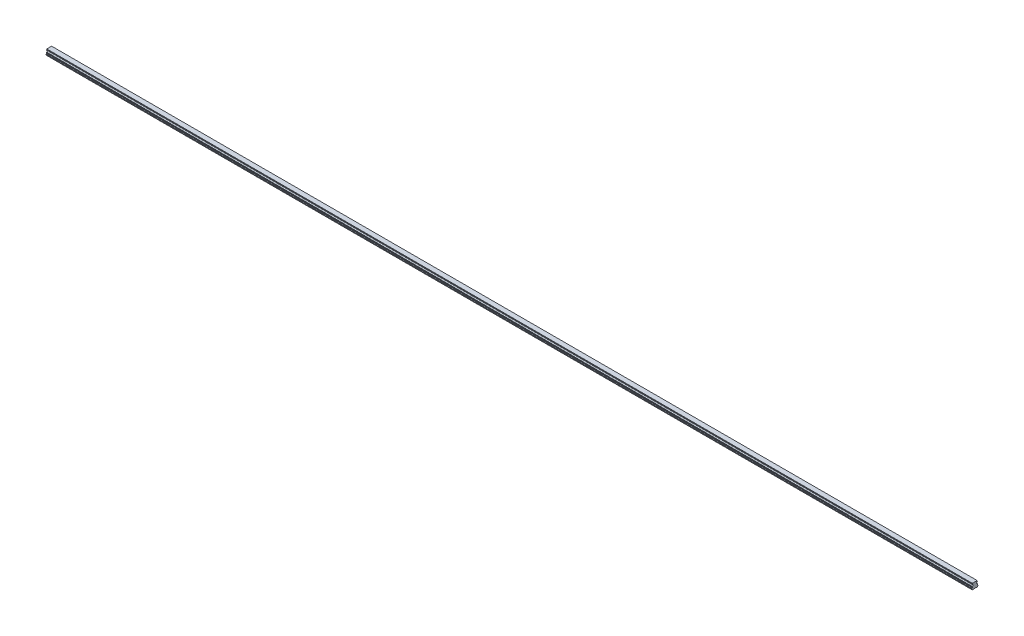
from build123d import *

# Parameters (mm, degrees)
BOSS_EXTRUDE1_DEPTH        = 3600
SKETCH3_R                  = 3
SKETCH3_R_2                = 2.5
CUT_EXTRUDE3_DEPTH         = 12
SKETCH3_2_R                = 2.5
CUT_EXTRUDE4_DEPTH         = 15
CHAMFER1_SIZE              = 0.5
LPATTERN4_COUNT            = 60
LPATTERN4_PITCH            = 60
CHAMFER1_OF_LPATTERN4_SIZE = 0.5


with BuildPart() as part:
    # Sketch1 → Boss-Extrude1 (new body)
    with BuildSketch(Plane(origin=(0, 0, 0), x_dir=(0, 0, -1), z_dir=(1, 0, 0))):
        with BuildLine():
            Line((9.375, 21.8), (-9.375, 21.8))
            Line((-9.375, 21.8), (-9.375, 20.756))
            Line((-9.375, 20.756), (-10, 19.415683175))
            Line((-10, 19.415683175), (-10, 17.685449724))
            ThreePointArc((-10, 17.685449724), (-7.2, 14.6), (-10, 11.514550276))
            Line((-10, 11.514550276), (-10, 9.784316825))
            Line((-10, 9.784316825), (-9.375, 8.444))
            Line((-9.375, 8.444), (-9.922688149, 6.4))
            Line((-9.922688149, 6.4), (-12.5, 5.489338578))
            Line((-12.5, 5.489338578), (-12.5, 2.65))
            Line((-12.5, 2.65), (-9.85, 0))
            Line((-9.85, 0), (-5.5, 0))
            Line((-5.5, 0), (-5, 0.5))
            Line((-5, 0.5), (5, 0.5))
            Line((5, 0.5), (5.5, 0))
            Line((5.5, 0), (9.85, 0))
            Line((9.85, 0), (12.5, 2.65))
            Line((12.5, 2.65), (12.5, 5.489338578))
            Line((12.5, 5.489338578), (9.922688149, 6.4))
            Line((9.922688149, 6.4), (9.375, 8.444))
            Line((9.375, 8.444), (10, 9.784316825))
            Line((10, 9.784316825), (10, 11.514550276))
            ThreePointArc((10, 11.514550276), (7.2, 14.6), (10, 17.685449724))
            Line((10, 17.685449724), (10, 19.415683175))
            Line((10, 19.415683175), (9.375, 20.756))
            Line((9.375, 20.756), (9.375, 21.8))
        make_face()
    extrude(amount=BOSS_EXTRUDE1_DEPTH)

    # Sketch3 → Cut-Extrude3 (cut)
    with BuildSketch(Plane.XZ):
        with Locations(Location((30, 0, 0), (0, 0, 270))):
            Circle(SKETCH3_R)
        with Locations(Location((30, 0, 0), (0, 0, 270))):
            Circle(SKETCH3_R_2, mode=Mode.SUBTRACT)
    cut_extrude3 = extrude(amount=-CUT_EXTRUDE3_DEPTH, mode=Mode.SUBTRACT)

    # Sketch3_2 → Cut-Extrude4 (cut)
    with BuildSketch(Plane.XZ):
        with Locations(Location((30, 0, 0), (0, 0, 270))):
            Circle(SKETCH3_2_R)
    cut_extrude4 = extrude(amount=-CUT_EXTRUDE4_DEPTH, mode=Mode.SUBTRACT)

    # Cut-Extrude5 cone 1 section (on through the dimple's axis) → Cut-Extrude5 (revolve, cut)
    with BuildSketch(Plane(origin=(30, 15, 0), x_dir=(0, 0, -1), z_dir=(1, 0, 0))):
        Polygon((0, 0), (2.5, 0), (0, 1.443375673), align=None)
    cut_extrude5 = revolve(axis=Axis((30, 15, 0), (0, 1, 0)), mode=Mode.SUBTRACT)

    # Chamfer1
    chamfer1_edges = [part.edges().sort_by_distance(p)[0] for p in [
        (30, 0.5, 3),
    ]]
    chamfer(chamfer1_edges, length=CHAMFER1_SIZE)

    # LPattern4: Cut-Extrude3, Cut-Extrude4, Cut-Extrude5 ×60
    with Locations(*[(i * LPATTERN4_PITCH, 0, 0) for i in range(1, LPATTERN4_COUNT)]):
        add(cut_extrude3, mode=Mode.SUBTRACT)
        add(cut_extrude4, mode=Mode.SUBTRACT)
        add(cut_extrude5, mode=Mode.SUBTRACT)

    # Chamfer1 of LPattern4
    chamfer1_of_lpattern4_edges = [part.edges().sort_by_distance(p)[0] for p in [
        (90, 0.5, 3),
        (150, 0.5, 3),
        (210, 0.5, 3),
        (270, 0.5, 3),
        (330, 0.5, 3),
        (390, 0.5, 3),
        (450, 0.5, 3),
        (510, 0.5, 3),
        (570, 0.5, 3),
        (630, 0.5, 3),
        (690, 0.5, 3),
        (750, 0.5, 3),
        (810, 0.5, 3),
        (870, 0.5, 3),
        (930, 0.5, 3),
        (990, 0.5, 3),
        (1050, 0.5, 3),
        (1110, 0.5, 3),
        (1170, 0.5, 3),
        (1230, 0.5, 3),
        (1290, 0.5, 3),
        (1350, 0.5, 3),
        (1410, 0.5, 3),
        (1470, 0.5, 3),
        (1530, 0.5, 3),
        (1590, 0.5, 3),
        (1650, 0.5, 3),
        (1710, 0.5, 3),
        (1770, 0.5, 3),
        (1830, 0.5, 3),
        (1890, 0.5, 3),
        (1950, 0.5, 3),
        (2010, 0.5, 3),
        (2070, 0.5, 3),
        (2130, 0.5, 3),
        (2190, 0.5, 3),
        (2250, 0.5, 3),
        (2310, 0.5, 3),
        (2370, 0.5, 3),
        (2430, 0.5, 3),
        (2490, 0.5, 3),
        (2550, 0.5, 3),
        (2610, 0.5, 3),
        (2670, 0.5, 3),
        (2730, 0.5, 3),
        (2790, 0.5, 3),
        (2850, 0.5, 3),
        (2910, 0.5, 3),
        (2970, 0.5, 3),
        (3030, 0.5, 3),
        (3090, 0.5, 3),
        (3150, 0.5, 3),
        (3210, 0.5, 3),
        (3270, 0.5, 3),
        (3330, 0.5, 3),
        (3390, 0.5, 3),
        (3450, 0.5, 3),
        (3510, 0.5, 3),
        (3570, 0.5, 3),
    ]]
    chamfer(chamfer1_of_lpattern4_edges, length=CHAMFER1_OF_LPATTERN4_SIZE)


solid = part.part
